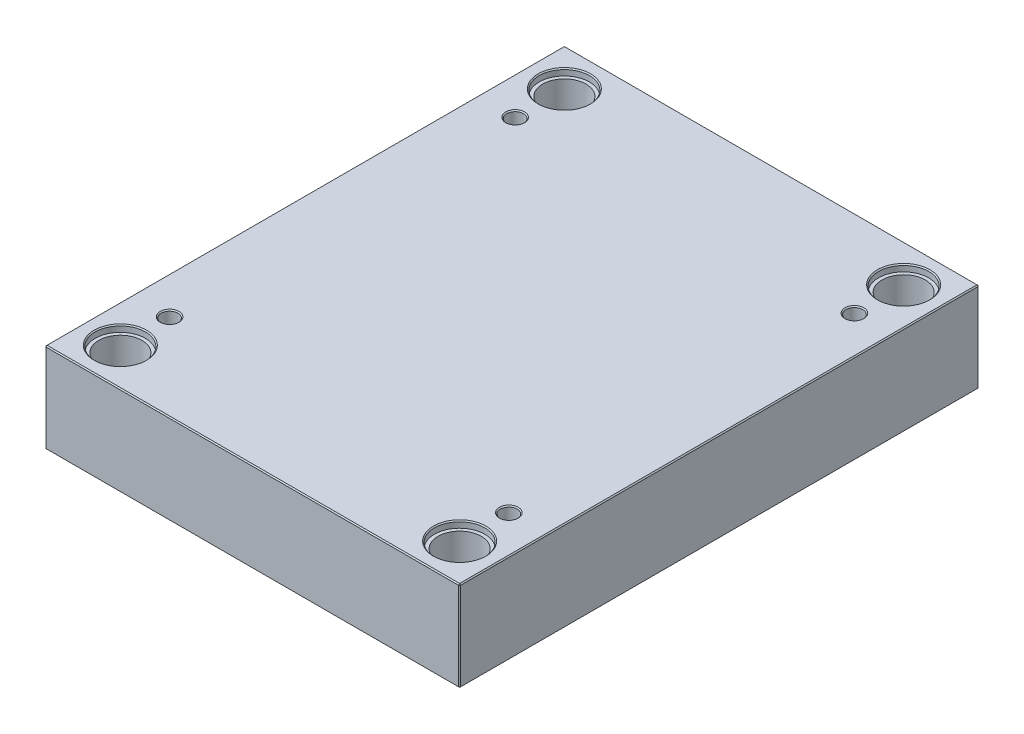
ISO-10303-21;
HEADER;
FILE_DESCRIPTION(('STEP AP214'),'2;1');
FILE_NAME('part.step','',(''),(''),'','','');
FILE_SCHEMA(('AUTOMOTIVE_DESIGN { 1 0 10303 214 1 1 1 1 }'));
ENDSEC;
DATA;
#1=APPLICATION_CONTEXT('core data for automotive mechanical design processes');
#2=APPLICATION_PROTOCOL_DEFINITION('international standard','automotive_design',2000,#1);
#3=PRODUCT_CONTEXT('',#1,'mechanical');
#4=PRODUCT('Part','Part','',(#3));
#5=PRODUCT_RELATED_PRODUCT_CATEGORY('part','',(#4));
#6=PRODUCT_DEFINITION_FORMATION('','',#4);
#7=PRODUCT_DEFINITION_CONTEXT('part definition',#1,'design');
#8=PRODUCT_DEFINITION('design','',#6,#7);
#9=PRODUCT_DEFINITION_SHAPE('','',#8);
#10=(LENGTH_UNIT() NAMED_UNIT(*) SI_UNIT(.MILLI.,.METRE.));
#11=(NAMED_UNIT(*) PLANE_ANGLE_UNIT() SI_UNIT($,.RADIAN.));
#12=(NAMED_UNIT(*) SI_UNIT($,.STERADIAN.) SOLID_ANGLE_UNIT());
#13=UNCERTAINTY_MEASURE_WITH_UNIT(LENGTH_MEASURE(1.E-05),#10,'distance_accuracy_value','');
#14=(GEOMETRIC_REPRESENTATION_CONTEXT(3) GLOBAL_UNCERTAINTY_ASSIGNED_CONTEXT((#13)) GLOBAL_UNIT_ASSIGNED_CONTEXT((#10,
#11,#12)) REPRESENTATION_CONTEXT('',''));
#15=CARTESIAN_POINT('',(0.,0.,0.));
#16=DIRECTION('',(0.,0.,1.));
#17=DIRECTION('',(1.,0.,0.));
#18=AXIS2_PLACEMENT_3D('',#15,#16,#17);
#19=CARTESIAN_POINT('',(-162.,0.,-212.));
#20=DIRECTION('',(0.,1.,0.));
#21=DIRECTION('',(0.,0.,1.));
#22=AXIS2_PLACEMENT_3D('',#19,#20,#21);
#23=CYLINDRICAL_SURFACE('',#22,20.65);
#24=CARTESIAN_POINT('',(-162.,0.999999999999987,-212.));
#25=DIRECTION('',(0.,1.,0.));
#26=DIRECTION('',(0.,0.,1.));
#27=AXIS2_PLACEMENT_3D('',#24,#25,#26);
#28=CIRCLE('',#27,20.65);
#29=CARTESIAN_POINT('',(-162.,0.999999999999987,-191.35));
#30=VERTEX_POINT('',#29);
#31=EDGE_CURVE('E471',#30,#30,#28,.F.);
#32=ORIENTED_EDGE('',*,*,#31,.T.);
#33=EDGE_LOOP('',(#32));
#34=FACE_BOUND('',#33,.T.);
#35=CARTESIAN_POINT('',(-162.,79.7,-212.));
#36=DIRECTION('',(0.,1.,0.));
#37=DIRECTION('',(0.,0.,1.));
#38=AXIS2_PLACEMENT_3D('',#35,#36,#37);
#39=CIRCLE('',#38,20.65);
#40=CARTESIAN_POINT('',(-162.,79.7,-191.35));
#41=VERTEX_POINT('',#40);
#42=EDGE_CURVE('E220',#41,#41,#39,.F.);
#43=ORIENTED_EDGE('',*,*,#42,.F.);
#44=EDGE_LOOP('',(#43));
#45=FACE_BOUND('',#44,.T.);
#46=ADVANCED_FACE('F15',(#34,#45),#23,.F.);
#47=CARTESIAN_POINT('',(162.,0.,-212.));
#48=DIRECTION('',(0.,1.,0.));
#49=DIRECTION('',(0.,0.,1.));
#50=AXIS2_PLACEMENT_3D('',#47,#48,#49);
#51=CYLINDRICAL_SURFACE('',#50,20.65);
#52=CARTESIAN_POINT('',(162.,0.999999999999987,-212.));
#53=DIRECTION('',(0.,1.,0.));
#54=DIRECTION('',(0.,0.,1.));
#55=AXIS2_PLACEMENT_3D('',#52,#53,#54);
#56=CIRCLE('',#55,20.65);
#57=CARTESIAN_POINT('',(162.,0.999999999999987,-191.35));
#58=VERTEX_POINT('',#57);
#59=EDGE_CURVE('E473',#58,#58,#56,.F.);
#60=ORIENTED_EDGE('',*,*,#59,.T.);
#61=EDGE_LOOP('',(#60));
#62=FACE_BOUND('',#61,.T.);
#63=CARTESIAN_POINT('',(162.,79.7,-212.));
#64=DIRECTION('',(0.,1.,0.));
#65=DIRECTION('',(0.,0.,1.));
#66=AXIS2_PLACEMENT_3D('',#63,#64,#65);
#67=CIRCLE('',#66,20.65);
#68=CARTESIAN_POINT('',(162.,79.7,-191.35));
#69=VERTEX_POINT('',#68);
#70=EDGE_CURVE('E217',#69,#69,#67,.F.);
#71=ORIENTED_EDGE('',*,*,#70,.F.);
#72=EDGE_LOOP('',(#71));
#73=FACE_BOUND('',#72,.T.);
#74=ADVANCED_FACE('F262',(#62,#73),#51,.F.);
#75=CARTESIAN_POINT('',(162.,0.,212.));
#76=DIRECTION('',(0.,1.,0.));
#77=DIRECTION('',(0.,0.,1.));
#78=AXIS2_PLACEMENT_3D('',#75,#76,#77);
#79=CYLINDRICAL_SURFACE('',#78,20.65);
#80=CARTESIAN_POINT('',(162.,1.00000000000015,212.));
#81=DIRECTION('',(0.,1.,0.));
#82=DIRECTION('',(0.,0.,1.));
#83=AXIS2_PLACEMENT_3D('',#80,#81,#82);
#84=CIRCLE('',#83,20.65);
#85=CARTESIAN_POINT('',(162.,1.00000000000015,232.65));
#86=VERTEX_POINT('',#85);
#87=EDGE_CURVE('E476',#86,#86,#84,.F.);
#88=ORIENTED_EDGE('',*,*,#87,.T.);
#89=EDGE_LOOP('',(#88));
#90=FACE_BOUND('',#89,.T.);
#91=CARTESIAN_POINT('',(162.,79.7,212.));
#92=DIRECTION('',(0.,1.,0.));
#93=DIRECTION('',(0.,0.,1.));
#94=AXIS2_PLACEMENT_3D('',#91,#92,#93);
#95=CIRCLE('',#94,20.65);
#96=CARTESIAN_POINT('',(162.,79.7,232.65));
#97=VERTEX_POINT('',#96);
#98=EDGE_CURVE('E213',#97,#97,#95,.F.);
#99=ORIENTED_EDGE('',*,*,#98,.F.);
#100=EDGE_LOOP('',(#99));
#101=FACE_BOUND('',#100,.T.);
#102=ADVANCED_FACE('F269',(#90,#101),#79,.F.);
#103=CARTESIAN_POINT('',(-162.,0.,212.));
#104=DIRECTION('',(0.,1.,0.));
#105=DIRECTION('',(0.,0.,1.));
#106=AXIS2_PLACEMENT_3D('',#103,#104,#105);
#107=CYLINDRICAL_SURFACE('',#106,20.65);
#108=CARTESIAN_POINT('',(-162.,0.999999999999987,212.));
#109=DIRECTION('',(0.,1.,0.));
#110=DIRECTION('',(0.,0.,1.));
#111=AXIS2_PLACEMENT_3D('',#108,#109,#110);
#112=CIRCLE('',#111,20.65);
#113=CARTESIAN_POINT('',(-162.,0.999999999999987,232.65));
#114=VERTEX_POINT('',#113);
#115=EDGE_CURVE('E479',#114,#114,#112,.F.);
#116=ORIENTED_EDGE('',*,*,#115,.T.);
#117=EDGE_LOOP('',(#116));
#118=FACE_BOUND('',#117,.T.);
#119=CARTESIAN_POINT('',(-162.,79.7,212.));
#120=DIRECTION('',(0.,1.,0.));
#121=DIRECTION('',(0.,0.,1.));
#122=AXIS2_PLACEMENT_3D('',#119,#120,#121);
#123=CIRCLE('',#122,20.65);
#124=CARTESIAN_POINT('',(-162.,79.7,232.65));
#125=VERTEX_POINT('',#124);
#126=EDGE_CURVE('E210',#125,#125,#123,.F.);
#127=ORIENTED_EDGE('',*,*,#126,.F.);
#128=EDGE_LOOP('',(#127));
#129=FACE_BOUND('',#128,.T.);
#130=ADVANCED_FACE('F276',(#118,#129),#107,.F.);
#131=CARTESIAN_POINT('',(-198.,86.,248.));
#132=DIRECTION('',(1.,0.,0.));
#133=DIRECTION('',(0.,0.,-1.));
#134=AXIS2_PLACEMENT_3D('',#131,#132,#133);
#135=PLANE('',#134);
#136=DIRECTION('',(0.,-1.,0.));
#137=VECTOR('',#136,1.);
#138=CARTESIAN_POINT('',(-198.,86.,-247.));
#139=LINE('',#138,#137);
#140=CARTESIAN_POINT('',(-198.,85.,-247.));
#141=VERTEX_POINT('',#140);
#142=CARTESIAN_POINT('',(-198.,1.00000000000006,-247.));
#143=VERTEX_POINT('',#142);
#144=EDGE_CURVE('E486',#141,#143,#139,.T.);
#145=ORIENTED_EDGE('',*,*,#144,.T.);
#146=DIRECTION('',(0.,0.,1.));
#147=VECTOR('',#146,1.);
#148=CARTESIAN_POINT('',(-198.,1.00000000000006,248.));
#149=LINE('',#148,#147);
#150=CARTESIAN_POINT('',(-198.,1.00000000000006,247.));
#151=VERTEX_POINT('',#150);
#152=EDGE_CURVE('E489',#143,#151,#149,.T.);
#153=ORIENTED_EDGE('',*,*,#152,.T.);
#154=DIRECTION('',(0.,1.,0.));
#155=VECTOR('',#154,1.);
#156=CARTESIAN_POINT('',(-198.,86.,247.));
#157=LINE('',#156,#155);
#158=CARTESIAN_POINT('',(-198.,85.,247.));
#159=VERTEX_POINT('',#158);
#160=EDGE_CURVE('E484',#151,#159,#157,.T.);
#161=ORIENTED_EDGE('',*,*,#160,.T.);
#162=DIRECTION('',(0.,0.,-1.));
#163=VECTOR('',#162,1.);
#164=CARTESIAN_POINT('',(-198.,85.,-248.));
#165=LINE('',#164,#163);
#166=EDGE_CURVE('E482',#159,#141,#165,.T.);
#167=ORIENTED_EDGE('',*,*,#166,.T.);
#168=EDGE_LOOP('',(#145,#153,#161,#167));
#169=FACE_BOUND('',#168,.T.);
#170=ADVANCED_FACE('F297',(#169),#135,.F.);
#171=CARTESIAN_POINT('',(198.,86.,248.));
#172=DIRECTION('',(0.,0.,-1.));
#173=DIRECTION('',(-1.,0.,0.));
#174=AXIS2_PLACEMENT_3D('',#171,#172,#173);
#175=PLANE('',#174);
#176=DIRECTION('',(-1.,0.,0.));
#177=VECTOR('',#176,1.);
#178=CARTESIAN_POINT('',(-198.,85.,248.));
#179=LINE('',#178,#177);
#180=CARTESIAN_POINT('',(197.,85.,248.));
#181=VERTEX_POINT('',#180);
#182=CARTESIAN_POINT('',(-197.,85.,248.));
#183=VERTEX_POINT('',#182);
#184=EDGE_CURVE('E508',#181,#183,#179,.T.);
#185=ORIENTED_EDGE('',*,*,#184,.T.);
#186=DIRECTION('',(0.,-1.,0.));
#187=VECTOR('',#186,1.);
#188=CARTESIAN_POINT('',(-197.,86.,248.));
#189=LINE('',#188,#187);
#190=CARTESIAN_POINT('',(-197.,1.,248.));
#191=VERTEX_POINT('',#190);
#192=EDGE_CURVE('E514',#183,#191,#189,.T.);
#193=ORIENTED_EDGE('',*,*,#192,.T.);
#194=DIRECTION('',(1.,0.,0.));
#195=VECTOR('',#194,1.);
#196=CARTESIAN_POINT('',(198.,1.,248.));
#197=LINE('',#196,#195);
#198=CARTESIAN_POINT('',(197.,1.,248.));
#199=VERTEX_POINT('',#198);
#200=EDGE_CURVE('E512',#191,#199,#197,.T.);
#201=ORIENTED_EDGE('',*,*,#200,.T.);
#202=DIRECTION('',(0.,1.,0.));
#203=VECTOR('',#202,1.);
#204=CARTESIAN_POINT('',(197.,86.,248.));
#205=LINE('',#204,#203);
#206=EDGE_CURVE('E510',#199,#181,#205,.T.);
#207=ORIENTED_EDGE('',*,*,#206,.T.);
#208=EDGE_LOOP('',(#185,#193,#201,#207));
#209=FACE_BOUND('',#208,.T.);
#210=ADVANCED_FACE('F293',(#209),#175,.F.);
#211=CARTESIAN_POINT('',(198.,86.,248.));
#212=DIRECTION('',(-1.,0.,0.));
#213=DIRECTION('',(0.,0.,1.));
#214=AXIS2_PLACEMENT_3D('',#211,#212,#213);
#215=PLANE('',#214);
#216=DIRECTION('',(0.,0.,-1.));
#217=VECTOR('',#216,1.);
#218=CARTESIAN_POINT('',(198.,1.,248.));
#219=LINE('',#218,#217);
#220=CARTESIAN_POINT('',(198.,1.,247.));
#221=VERTEX_POINT('',#220);
#222=CARTESIAN_POINT('',(198.,1.,-247.));
#223=VERTEX_POINT('',#222);
#224=EDGE_CURVE('E503',#221,#223,#219,.T.);
#225=ORIENTED_EDGE('',*,*,#224,.T.);
#226=DIRECTION('',(0.,1.,0.));
#227=VECTOR('',#226,1.);
#228=CARTESIAN_POINT('',(198.,86.,-247.));
#229=LINE('',#228,#227);
#230=CARTESIAN_POINT('',(198.,85.,-247.));
#231=VERTEX_POINT('',#230);
#232=EDGE_CURVE('E505',#223,#231,#229,.T.);
#233=ORIENTED_EDGE('',*,*,#232,.T.);
#234=DIRECTION('',(0.,0.,1.));
#235=VECTOR('',#234,1.);
#236=CARTESIAN_POINT('',(198.,85.,248.));
#237=LINE('',#236,#235);
#238=CARTESIAN_POINT('',(198.,85.,247.));
#239=VERTEX_POINT('',#238);
#240=EDGE_CURVE('E499',#231,#239,#237,.T.);
#241=ORIENTED_EDGE('',*,*,#240,.T.);
#242=DIRECTION('',(0.,-1.,0.));
#243=VECTOR('',#242,1.);
#244=CARTESIAN_POINT('',(198.,86.,247.));
#245=LINE('',#244,#243);
#246=EDGE_CURVE('E501',#239,#221,#245,.T.);
#247=ORIENTED_EDGE('',*,*,#246,.T.);
#248=EDGE_LOOP('',(#225,#233,#241,#247));
#249=FACE_BOUND('',#248,.T.);
#250=ADVANCED_FACE('F289',(#249),#215,.F.);
#251=CARTESIAN_POINT('',(198.,86.,-248.));
#252=DIRECTION('',(0.,0.,1.));
#253=DIRECTION('',(1.,0.,0.));
#254=AXIS2_PLACEMENT_3D('',#251,#252,#253);
#255=PLANE('',#254);
#256=DIRECTION('',(0.,-1.,0.));
#257=VECTOR('',#256,1.);
#258=CARTESIAN_POINT('',(197.,86.,-248.));
#259=LINE('',#258,#257);
#260=CARTESIAN_POINT('',(197.,85.,-248.));
#261=VERTEX_POINT('',#260);
#262=CARTESIAN_POINT('',(197.,1.,-248.));
#263=VERTEX_POINT('',#262);
#264=EDGE_CURVE('E493',#261,#263,#259,.T.);
#265=ORIENTED_EDGE('',*,*,#264,.T.);
#266=DIRECTION('',(-1.,0.,0.));
#267=VECTOR('',#266,1.);
#268=CARTESIAN_POINT('',(198.,1.,-248.));
#269=LINE('',#268,#267);
#270=CARTESIAN_POINT('',(-197.,1.,-248.));
#271=VERTEX_POINT('',#270);
#272=EDGE_CURVE('E137',#263,#271,#269,.T.);
#273=ORIENTED_EDGE('',*,*,#272,.T.);
#274=DIRECTION('',(0.,1.,0.));
#275=VECTOR('',#274,1.);
#276=CARTESIAN_POINT('',(-197.,86.,-248.));
#277=LINE('',#276,#275);
#278=CARTESIAN_POINT('',(-197.,85.,-248.));
#279=VERTEX_POINT('',#278);
#280=EDGE_CURVE('E495',#271,#279,#277,.T.);
#281=ORIENTED_EDGE('',*,*,#280,.T.);
#282=DIRECTION('',(1.,0.,0.));
#283=VECTOR('',#282,1.);
#284=CARTESIAN_POINT('',(198.,85.,-248.));
#285=LINE('',#284,#283);
#286=EDGE_CURVE('E491',#279,#261,#285,.T.);
#287=ORIENTED_EDGE('',*,*,#286,.T.);
#288=EDGE_LOOP('',(#265,#273,#281,#287));
#289=FACE_BOUND('',#288,.T.);
#290=ADVANCED_FACE('F281',(#289),#255,.F.);
#291=CARTESIAN_POINT('',(0.,86.,0.));
#292=DIRECTION('',(0.,1.,0.));
#293=DIRECTION('',(0.,0.,1.));
#294=AXIS2_PLACEMENT_3D('',#291,#292,#293);
#295=PLANE('',#294);
#296=CARTESIAN_POINT('',(162.,86.,212.));
#297=DIRECTION('',(0.,1.,0.));
#298=DIRECTION('',(0.,0.,1.));
#299=AXIS2_PLACEMENT_3D('',#296,#297,#298);
#300=CIRCLE('',#299,25.);
#301=CARTESIAN_POINT('',(162.,86.,237.));
#302=VERTEX_POINT('',#301);
#303=EDGE_CURVE('E235',#302,#302,#300,.F.);
#304=ORIENTED_EDGE('',*,*,#303,.T.);
#305=EDGE_LOOP('',(#304));
#306=FACE_BOUND('',#305,.T.);
#307=CARTESIAN_POINT('',(-162.,86.,212.));
#308=DIRECTION('',(0.,1.,0.));
#309=DIRECTION('',(0.,0.,1.));
#310=AXIS2_PLACEMENT_3D('',#307,#308,#309);
#311=CIRCLE('',#310,25.);
#312=CARTESIAN_POINT('',(-162.,86.,237.));
#313=VERTEX_POINT('',#312);
#314=EDGE_CURVE('E232',#313,#313,#311,.F.);
#315=ORIENTED_EDGE('',*,*,#314,.T.);
#316=EDGE_LOOP('',(#315));
#317=FACE_BOUND('',#316,.T.);
#318=CARTESIAN_POINT('',(162.,86.,-212.));
#319=DIRECTION('',(0.,1.,0.));
#320=DIRECTION('',(0.,0.,1.));
#321=AXIS2_PLACEMENT_3D('',#318,#319,#320);
#322=CIRCLE('',#321,25.);
#323=CARTESIAN_POINT('',(162.,86.,-187.));
#324=VERTEX_POINT('',#323);
#325=EDGE_CURVE('E229',#324,#324,#322,.F.);
#326=ORIENTED_EDGE('',*,*,#325,.T.);
#327=EDGE_LOOP('',(#326));
#328=FACE_BOUND('',#327,.T.);
#329=CARTESIAN_POINT('',(-162.,86.,-212.));
#330=DIRECTION('',(0.,1.,0.));
#331=DIRECTION('',(0.,0.,1.));
#332=AXIS2_PLACEMENT_3D('',#329,#330,#331);
#333=CIRCLE('',#332,25.);
#334=CARTESIAN_POINT('',(-162.,86.,-187.));
#335=VERTEX_POINT('',#334);
#336=EDGE_CURVE('E226',#335,#335,#333,.F.);
#337=ORIENTED_EDGE('',*,*,#336,.T.);
#338=EDGE_LOOP('',(#337));
#339=FACE_BOUND('',#338,.T.);
#340=CARTESIAN_POINT('',(-162.,86.,165.));
#341=DIRECTION('',(0.,1.,0.));
#342=DIRECTION('',(0.,0.,1.));
#343=AXIS2_PLACEMENT_3D('',#340,#341,#342);
#344=CIRCLE('',#343,9.);
#345=CARTESIAN_POINT('',(-162.,86.,174.));
#346=VERTEX_POINT('',#345);
#347=EDGE_CURVE('E197',#346,#346,#344,.F.);
#348=ORIENTED_EDGE('',*,*,#347,.T.);
#349=EDGE_LOOP('',(#348));
#350=FACE_BOUND('',#349,.T.);
#351=CARTESIAN_POINT('',(162.,86.,165.));
#352=DIRECTION('',(0.,1.,0.));
#353=DIRECTION('',(0.,0.,1.));
#354=AXIS2_PLACEMENT_3D('',#351,#352,#353);
#355=CIRCLE('',#354,9.);
#356=CARTESIAN_POINT('',(162.,86.,174.));
#357=VERTEX_POINT('',#356);
#358=EDGE_CURVE('E194',#357,#357,#355,.F.);
#359=ORIENTED_EDGE('',*,*,#358,.T.);
#360=EDGE_LOOP('',(#359));
#361=FACE_BOUND('',#360,.T.);
#362=CARTESIAN_POINT('',(162.,86.,-165.));
#363=DIRECTION('',(0.,1.,0.));
#364=DIRECTION('',(0.,0.,1.));
#365=AXIS2_PLACEMENT_3D('',#362,#363,#364);
#366=CIRCLE('',#365,9.);
#367=CARTESIAN_POINT('',(162.,86.,-156.));
#368=VERTEX_POINT('',#367);
#369=EDGE_CURVE('E191',#368,#368,#366,.F.);
#370=ORIENTED_EDGE('',*,*,#369,.T.);
#371=EDGE_LOOP('',(#370));
#372=FACE_BOUND('',#371,.T.);
#373=CARTESIAN_POINT('',(-162.,86.,-165.));
#374=DIRECTION('',(0.,1.,0.));
#375=DIRECTION('',(0.,0.,1.));
#376=AXIS2_PLACEMENT_3D('',#373,#374,#375);
#377=CIRCLE('',#376,9.);
#378=CARTESIAN_POINT('',(-162.,86.,-156.));
#379=VERTEX_POINT('',#378);
#380=EDGE_CURVE('E187',#379,#379,#377,.F.);
#381=ORIENTED_EDGE('',*,*,#380,.T.);
#382=EDGE_LOOP('',(#381));
#383=FACE_BOUND('',#382,.T.);
#384=DIRECTION('',(0.,0.,-1.));
#385=VECTOR('',#384,1.);
#386=CARTESIAN_POINT('',(197.,86.,-248.));
#387=LINE('',#386,#385);
#388=CARTESIAN_POINT('',(197.,86.,247.));
#389=VERTEX_POINT('',#388);
#390=CARTESIAN_POINT('',(197.,86.,-247.));
#391=VERTEX_POINT('',#390);
#392=EDGE_CURVE('E30',#389,#391,#387,.T.);
#393=ORIENTED_EDGE('',*,*,#392,.T.);
#394=DIRECTION('',(-1.,0.,0.));
#395=VECTOR('',#394,1.);
#396=CARTESIAN_POINT('',(-198.,86.,-247.));
#397=LINE('',#396,#395);
#398=CARTESIAN_POINT('',(-197.,86.,-247.));
#399=VERTEX_POINT('',#398);
#400=EDGE_CURVE('E188',#391,#399,#397,.T.);
#401=ORIENTED_EDGE('',*,*,#400,.T.);
#402=DIRECTION('',(0.,0.,1.));
#403=VECTOR('',#402,1.);
#404=CARTESIAN_POINT('',(-197.,86.,248.));
#405=LINE('',#404,#403);
#406=CARTESIAN_POINT('',(-197.,86.,247.));
#407=VERTEX_POINT('',#406);
#408=EDGE_CURVE('E517',#399,#407,#405,.T.);
#409=ORIENTED_EDGE('',*,*,#408,.T.);
#410=DIRECTION('',(1.,0.,0.));
#411=VECTOR('',#410,1.);
#412=CARTESIAN_POINT('',(198.,86.,247.));
#413=LINE('',#412,#411);
#414=EDGE_CURVE('E35',#407,#389,#413,.T.);
#415=ORIENTED_EDGE('',*,*,#414,.T.);
#416=EDGE_LOOP('',(#393,#401,#409,#415));
#417=FACE_BOUND('',#416,.T.);
#418=ADVANCED_FACE('F278',(#306,#317,#328,#339,#350,#361,#372,#383,#417),#295,.T.);
#419=CARTESIAN_POINT('',(0.,0.,0.));
#420=DIRECTION('',(0.,1.,0.));
#421=DIRECTION('',(0.,0.,1.));
#422=AXIS2_PLACEMENT_3D('',#419,#420,#421);
#423=PLANE('',#422);
#424=CARTESIAN_POINT('',(-162.,0.,-212.));
#425=DIRECTION('',(0.,1.,0.));
#426=DIRECTION('',(0.,0.,1.));
#427=AXIS2_PLACEMENT_3D('',#424,#425,#426);
#428=CIRCLE('',#427,21.65);
#429=CARTESIAN_POINT('',(-162.,0.,-190.35));
#430=VERTEX_POINT('',#429);
#431=EDGE_CURVE('E468',#430,#430,#428,.T.);
#432=ORIENTED_EDGE('',*,*,#431,.T.);
#433=EDGE_LOOP('',(#432));
#434=FACE_BOUND('',#433,.T.);
#435=CARTESIAN_POINT('',(162.,0.,-212.));
#436=DIRECTION('',(0.,1.,0.));
#437=DIRECTION('',(0.,0.,1.));
#438=AXIS2_PLACEMENT_3D('',#435,#436,#437);
#439=CIRCLE('',#438,21.65);
#440=CARTESIAN_POINT('',(162.,0.,-190.35));
#441=VERTEX_POINT('',#440);
#442=EDGE_CURVE('E465',#441,#441,#439,.T.);
#443=ORIENTED_EDGE('',*,*,#442,.T.);
#444=EDGE_LOOP('',(#443));
#445=FACE_BOUND('',#444,.T.);
#446=CARTESIAN_POINT('',(162.,0.,212.));
#447=DIRECTION('',(0.,1.,0.));
#448=DIRECTION('',(0.,0.,1.));
#449=AXIS2_PLACEMENT_3D('',#446,#447,#448);
#450=CIRCLE('',#449,21.6500000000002);
#451=CARTESIAN_POINT('',(162.,0.,233.65));
#452=VERTEX_POINT('',#451);
#453=EDGE_CURVE('E462',#452,#452,#450,.T.);
#454=ORIENTED_EDGE('',*,*,#453,.T.);
#455=EDGE_LOOP('',(#454));
#456=FACE_BOUND('',#455,.T.);
#457=CARTESIAN_POINT('',(-162.,0.,212.));
#458=DIRECTION('',(0.,1.,0.));
#459=DIRECTION('',(0.,0.,1.));
#460=AXIS2_PLACEMENT_3D('',#457,#458,#459);
#461=CIRCLE('',#460,21.65);
#462=CARTESIAN_POINT('',(-162.,0.,233.65));
#463=VERTEX_POINT('',#462);
#464=EDGE_CURVE('E459',#463,#463,#461,.T.);
#465=ORIENTED_EDGE('',*,*,#464,.T.);
#466=EDGE_LOOP('',(#465));
#467=FACE_BOUND('',#466,.T.);
#468=DIRECTION('',(0.,0.,1.));
#469=VECTOR('',#468,1.);
#470=CARTESIAN_POINT('',(197.,0.,0.));
#471=LINE('',#470,#469);
#472=CARTESIAN_POINT('',(197.,0.,-247.));
#473=VERTEX_POINT('',#472);
#474=CARTESIAN_POINT('',(197.,0.,247.));
#475=VERTEX_POINT('',#474);
#476=EDGE_CURVE('E107',#473,#475,#471,.T.);
#477=ORIENTED_EDGE('',*,*,#476,.T.);
#478=DIRECTION('',(-1.,0.,0.));
#479=VECTOR('',#478,1.);
#480=CARTESIAN_POINT('',(0.,0.,247.));
#481=LINE('',#480,#479);
#482=CARTESIAN_POINT('',(-197.,0.,247.));
#483=VERTEX_POINT('',#482);
#484=EDGE_CURVE('E457',#475,#483,#481,.T.);
#485=ORIENTED_EDGE('',*,*,#484,.T.);
#486=DIRECTION('',(0.,0.,-1.));
#487=VECTOR('',#486,1.);
#488=CARTESIAN_POINT('',(-197.,0.,0.));
#489=LINE('',#488,#487);
#490=CARTESIAN_POINT('',(-197.,0.,-247.));
#491=VERTEX_POINT('',#490);
#492=EDGE_CURVE('E109',#483,#491,#489,.T.);
#493=ORIENTED_EDGE('',*,*,#492,.T.);
#494=DIRECTION('',(1.,0.,0.));
#495=VECTOR('',#494,1.);
#496=CARTESIAN_POINT('',(0.,0.,-247.));
#497=LINE('',#496,#495);
#498=EDGE_CURVE('E103',#491,#473,#497,.T.);
#499=ORIENTED_EDGE('',*,*,#498,.T.);
#500=EDGE_LOOP('',(#477,#485,#493,#499));
#501=FACE_BOUND('',#500,.T.);
#502=ADVANCED_FACE('F105',(#434,#445,#456,#467,#501),#423,.F.);
#503=CARTESIAN_POINT('',(-162.,0.,-212.));
#504=DIRECTION('',(0.,-1.,0.));
#505=DIRECTION('',(0.,0.,-1.));
#506=AXIS2_PLACEMENT_3D('',#503,#504,#505);
#507=CONICAL_SURFACE('',#506,21.65,0.785398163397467);
#508=ORIENTED_EDGE('',*,*,#31,.F.);
#509=EDGE_LOOP('',(#508));
#510=FACE_BOUND('',#509,.T.);
#511=ORIENTED_EDGE('',*,*,#431,.F.);
#512=EDGE_LOOP('',(#511));
#513=FACE_BOUND('',#512,.T.);
#514=ADVANCED_FACE('F285',(#510,#513),#507,.F.);
#515=CARTESIAN_POINT('',(162.,0.,-212.));
#516=DIRECTION('',(0.,-1.,0.));
#517=DIRECTION('',(0.,0.,-1.));
#518=AXIS2_PLACEMENT_3D('',#515,#516,#517);
#519=CONICAL_SURFACE('',#518,21.65,0.785398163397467);
#520=ORIENTED_EDGE('',*,*,#59,.F.);
#521=EDGE_LOOP('',(#520));
#522=FACE_BOUND('',#521,.T.);
#523=ORIENTED_EDGE('',*,*,#442,.F.);
#524=EDGE_LOOP('',(#523));
#525=FACE_BOUND('',#524,.T.);
#526=ADVANCED_FACE('F304',(#522,#525),#519,.F.);
#527=CARTESIAN_POINT('',(162.,0.,212.));
#528=DIRECTION('',(0.,-1.,0.));
#529=DIRECTION('',(0.,0.,-1.));
#530=AXIS2_PLACEMENT_3D('',#527,#528,#529);
#531=CONICAL_SURFACE('',#530,21.6500000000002,0.785398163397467);
#532=ORIENTED_EDGE('',*,*,#87,.F.);
#533=EDGE_LOOP('',(#532));
#534=FACE_BOUND('',#533,.T.);
#535=ORIENTED_EDGE('',*,*,#453,.F.);
#536=EDGE_LOOP('',(#535));
#537=FACE_BOUND('',#536,.T.);
#538=ADVANCED_FACE('F308',(#534,#537),#531,.F.);
#539=CARTESIAN_POINT('',(-162.,0.,212.));
#540=DIRECTION('',(0.,-1.,0.));
#541=DIRECTION('',(0.,0.,-1.));
#542=AXIS2_PLACEMENT_3D('',#539,#540,#541);
#543=CONICAL_SURFACE('',#542,21.65,0.785398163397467);
#544=ORIENTED_EDGE('',*,*,#115,.F.);
#545=EDGE_LOOP('',(#544));
#546=FACE_BOUND('',#545,.T.);
#547=ORIENTED_EDGE('',*,*,#464,.F.);
#548=EDGE_LOOP('',(#547));
#549=FACE_BOUND('',#548,.T.);
#550=ADVANCED_FACE('F312',(#546,#549),#543,.F.);
#551=CARTESIAN_POINT('',(198.,86.,247.));
#552=DIRECTION('',(-0.707106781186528,0.,-0.707106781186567));
#553=DIRECTION('',(0.,-1.,0.));
#554=AXIS2_PLACEMENT_3D('',#551,#552,#553);
#555=PLANE('',#554);
#556=DIRECTION('',(-0.707106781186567,0.,0.707106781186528));
#557=VECTOR('',#556,1.);
#558=CARTESIAN_POINT('',(197.,85.,248.));
#559=LINE('',#558,#557);
#560=EDGE_CURVE('E125',#181,#239,#559,.F.);
#561=ORIENTED_EDGE('',*,*,#560,.F.);
#562=ORIENTED_EDGE('',*,*,#206,.F.);
#563=DIRECTION('',(0.707106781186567,0.,-0.707106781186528));
#564=VECTOR('',#563,1.);
#565=CARTESIAN_POINT('',(197.,1.,248.));
#566=LINE('',#565,#564);
#567=EDGE_CURVE('E179',#221,#199,#566,.F.);
#568=ORIENTED_EDGE('',*,*,#567,.F.);
#569=ORIENTED_EDGE('',*,*,#246,.F.);
#570=EDGE_LOOP('',(#561,#562,#568,#569));
#571=FACE_BOUND('',#570,.T.);
#572=ADVANCED_FACE('F316',(#571),#555,.F.);
#573=CARTESIAN_POINT('',(197.,85.,248.));
#574=DIRECTION('',(0.577350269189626,0.577350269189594,0.577350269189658));
#575=DIRECTION('',(0.707106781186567,0.,-0.707106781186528));
#576=AXIS2_PLACEMENT_3D('',#573,#574,#575);
#577=PLANE('',#576);
#578=DIRECTION('',(0.,-0.707106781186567,0.707106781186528));
#579=VECTOR('',#578,1.);
#580=CARTESIAN_POINT('',(197.,85.,248.));
#581=LINE('',#580,#579);
#582=EDGE_CURVE('E174',#181,#389,#581,.F.);
#583=ORIENTED_EDGE('',*,*,#582,.F.);
#584=ORIENTED_EDGE('',*,*,#560,.T.);
#585=DIRECTION('',(-0.707106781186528,0.707106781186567,0.));
#586=VECTOR('',#585,1.);
#587=CARTESIAN_POINT('',(197.5,85.5,247.));
#588=LINE('',#587,#586);
#589=EDGE_CURVE('E176',#389,#239,#588,.F.);
#590=ORIENTED_EDGE('',*,*,#589,.F.);
#591=EDGE_LOOP('',(#583,#584,#590));
#592=FACE_BOUND('',#591,.T.);
#593=ADVANCED_FACE('F384',(#592),#577,.T.);
#594=CARTESIAN_POINT('',(197.,1.,248.));
#595=DIRECTION('',(0.577350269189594,-0.577350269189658,0.577350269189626));
#596=DIRECTION('',(0.,-0.707106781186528,-0.707106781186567));
#597=AXIS2_PLACEMENT_3D('',#594,#595,#596);
#598=PLANE('',#597);
#599=DIRECTION('',(-0.707106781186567,-0.707106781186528,0.));
#600=VECTOR('',#599,1.);
#601=CARTESIAN_POINT('',(197.5,0.5,247.));
#602=LINE('',#601,#600);
#603=EDGE_CURVE('E123',#221,#475,#602,.T.);
#604=ORIENTED_EDGE('',*,*,#603,.F.);
#605=ORIENTED_EDGE('',*,*,#567,.T.);
#606=DIRECTION('',(0.,0.707106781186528,0.707106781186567));
#607=VECTOR('',#606,1.);
#608=CARTESIAN_POINT('',(197.,1.,248.));
#609=LINE('',#608,#607);
#610=EDGE_CURVE('E171',#475,#199,#609,.T.);
#611=ORIENTED_EDGE('',*,*,#610,.F.);
#612=EDGE_LOOP('',(#604,#605,#611));
#613=FACE_BOUND('',#612,.T.);
#614=ADVANCED_FACE('F380',(#613),#598,.T.);
#615=CARTESIAN_POINT('',(197.,86.,0.));
#616=DIRECTION('',(0.707106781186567,0.707106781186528,0.));
#617=DIRECTION('',(0.,0.,1.));
#618=AXIS2_PLACEMENT_3D('',#615,#616,#617);
#619=PLANE('',#618);
#620=ORIENTED_EDGE('',*,*,#589,.T.);
#621=ORIENTED_EDGE('',*,*,#240,.F.);
#622=DIRECTION('',(0.707106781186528,-0.707106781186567,0.));
#623=VECTOR('',#622,1.);
#624=CARTESIAN_POINT('',(198.,85.,-247.));
#625=LINE('',#624,#623);
#626=EDGE_CURVE('E165',#391,#231,#625,.T.);
#627=ORIENTED_EDGE('',*,*,#626,.F.);
#628=ORIENTED_EDGE('',*,*,#392,.F.);
#629=EDGE_LOOP('',(#620,#621,#627,#628));
#630=FACE_BOUND('',#629,.T.);
#631=ADVANCED_FACE('F376',(#630),#619,.T.);
#632=CARTESIAN_POINT('',(0.,86.,247.));
#633=DIRECTION('',(0.,0.707106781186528,0.707106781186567));
#634=DIRECTION('',(-1.,0.,0.));
#635=AXIS2_PLACEMENT_3D('',#632,#633,#634);
#636=PLANE('',#635);
#637=ORIENTED_EDGE('',*,*,#582,.T.);
#638=ORIENTED_EDGE('',*,*,#414,.F.);
#639=DIRECTION('',(0.,0.707106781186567,-0.707106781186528));
#640=VECTOR('',#639,1.);
#641=CARTESIAN_POINT('',(-197.,85.5,247.5));
#642=LINE('',#641,#640);
#643=EDGE_CURVE('E162',#183,#407,#642,.T.);
#644=ORIENTED_EDGE('',*,*,#643,.F.);
#645=ORIENTED_EDGE('',*,*,#184,.F.);
#646=EDGE_LOOP('',(#637,#638,#644,#645));
#647=FACE_BOUND('',#646,.T.);
#648=ADVANCED_FACE('F372',(#647),#636,.T.);
#649=CARTESIAN_POINT('',(-197.,86.,248.));
#650=DIRECTION('',(0.707106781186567,0.,-0.707106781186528));
#651=DIRECTION('',(0.,-1.,0.));
#652=AXIS2_PLACEMENT_3D('',#649,#650,#651);
#653=PLANE('',#652);
#654=DIRECTION('',(0.707106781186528,0.,0.707106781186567));
#655=VECTOR('',#654,1.);
#656=CARTESIAN_POINT('',(-197.,1.,248.));
#657=LINE('',#656,#655);
#658=EDGE_CURVE('E156',#191,#151,#657,.F.);
#659=ORIENTED_EDGE('',*,*,#658,.F.);
#660=ORIENTED_EDGE('',*,*,#192,.F.);
#661=DIRECTION('',(-0.707106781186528,0.,-0.707106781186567));
#662=VECTOR('',#661,1.);
#663=CARTESIAN_POINT('',(-198.,85.,247.));
#664=LINE('',#663,#662);
#665=EDGE_CURVE('E159',#159,#183,#664,.F.);
#666=ORIENTED_EDGE('',*,*,#665,.F.);
#667=ORIENTED_EDGE('',*,*,#160,.F.);
#668=EDGE_LOOP('',(#659,#660,#666,#667));
#669=FACE_BOUND('',#668,.T.);
#670=ADVANCED_FACE('F368',(#669),#653,.F.);
#671=CARTESIAN_POINT('',(198.,1.,248.));
#672=DIRECTION('',(0.,0.707106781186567,-0.707106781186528));
#673=DIRECTION('',(1.,0.,0.));
#674=AXIS2_PLACEMENT_3D('',#671,#672,#673);
#675=PLANE('',#674);
#676=ORIENTED_EDGE('',*,*,#610,.T.);
#677=ORIENTED_EDGE('',*,*,#200,.F.);
#678=DIRECTION('',(0.,-0.707106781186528,-0.707106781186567));
#679=VECTOR('',#678,1.);
#680=CARTESIAN_POINT('',(-197.,1.,248.));
#681=LINE('',#680,#679);
#682=EDGE_CURVE('E134',#483,#191,#681,.F.);
#683=ORIENTED_EDGE('',*,*,#682,.F.);
#684=ORIENTED_EDGE('',*,*,#484,.F.);
#685=EDGE_LOOP('',(#676,#677,#683,#684));
#686=FACE_BOUND('',#685,.T.);
#687=ADVANCED_FACE('F365',(#686),#675,.F.);
#688=CARTESIAN_POINT('',(198.,1.,248.));
#689=DIRECTION('',(-0.707106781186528,0.707106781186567,0.));
#690=DIRECTION('',(0.,0.,-1.));
#691=AXIS2_PLACEMENT_3D('',#688,#689,#690);
#692=PLANE('',#691);
#693=ORIENTED_EDGE('',*,*,#603,.T.);
#694=ORIENTED_EDGE('',*,*,#476,.F.);
#695=DIRECTION('',(0.707106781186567,0.707106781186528,0.));
#696=VECTOR('',#695,1.);
#697=CARTESIAN_POINT('',(197.5,0.499999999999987,-247.));
#698=LINE('',#697,#696);
#699=EDGE_CURVE('E120',#223,#473,#698,.F.);
#700=ORIENTED_EDGE('',*,*,#699,.F.);
#701=ORIENTED_EDGE('',*,*,#224,.F.);
#702=EDGE_LOOP('',(#693,#694,#700,#701));
#703=FACE_BOUND('',#702,.T.);
#704=ADVANCED_FACE('F118',(#703),#692,.F.);
#705=CARTESIAN_POINT('',(197.,86.,-248.));
#706=DIRECTION('',(-0.707106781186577,0.,0.707106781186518));
#707=DIRECTION('',(0.,-1.,0.));
#708=AXIS2_PLACEMENT_3D('',#705,#706,#707);
#709=PLANE('',#708);
#710=DIRECTION('',(0.707106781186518,0.,0.707106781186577));
#711=VECTOR('',#710,1.);
#712=CARTESIAN_POINT('',(198.,85.,-247.));
#713=LINE('',#712,#711);
#714=EDGE_CURVE('E167',#231,#261,#713,.F.);
#715=ORIENTED_EDGE('',*,*,#714,.F.);
#716=ORIENTED_EDGE('',*,*,#232,.F.);
#717=DIRECTION('',(-0.707106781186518,0.,-0.707106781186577));
#718=VECTOR('',#717,1.);
#719=CARTESIAN_POINT('',(197.,1.,-248.));
#720=LINE('',#719,#718);
#721=EDGE_CURVE('E133',#263,#223,#720,.F.);
#722=ORIENTED_EDGE('',*,*,#721,.F.);
#723=ORIENTED_EDGE('',*,*,#264,.F.);
#724=EDGE_LOOP('',(#715,#716,#722,#723));
#725=FACE_BOUND('',#724,.T.);
#726=ADVANCED_FACE('F358',(#725),#709,.F.);
#727=CARTESIAN_POINT('',(198.,85.,-247.));
#728=DIRECTION('',(0.577350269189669,0.577350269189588,-0.57735026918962));
#729=DIRECTION('',(-0.707106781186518,0.,-0.707106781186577));
#730=AXIS2_PLACEMENT_3D('',#727,#728,#729);
#731=PLANE('',#730);
#732=ORIENTED_EDGE('',*,*,#626,.T.);
#733=ORIENTED_EDGE('',*,*,#714,.T.);
#734=DIRECTION('',(0.,0.707106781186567,0.707106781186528));
#735=VECTOR('',#734,1.);
#736=CARTESIAN_POINT('',(197.,85.5,-247.5));
#737=LINE('',#736,#735);
#738=EDGE_CURVE('E151',#391,#261,#737,.F.);
#739=ORIENTED_EDGE('',*,*,#738,.F.);
#740=EDGE_LOOP('',(#732,#733,#739));
#741=FACE_BOUND('',#740,.T.);
#742=ADVANCED_FACE('F354',(#741),#731,.T.);
#743=CARTESIAN_POINT('',(-198.,85.,247.));
#744=DIRECTION('',(-0.577350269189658,0.577350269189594,0.577350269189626));
#745=DIRECTION('',(0.707106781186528,0.,0.707106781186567));
#746=AXIS2_PLACEMENT_3D('',#743,#744,#745);
#747=PLANE('',#746);
#748=ORIENTED_EDGE('',*,*,#665,.T.);
#749=ORIENTED_EDGE('',*,*,#643,.T.);
#750=DIRECTION('',(-0.707106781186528,-0.707106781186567,0.));
#751=VECTOR('',#750,1.);
#752=CARTESIAN_POINT('',(-198.,85.,247.));
#753=LINE('',#752,#751);
#754=EDGE_CURVE('E142',#159,#407,#753,.F.);
#755=ORIENTED_EDGE('',*,*,#754,.F.);
#756=EDGE_LOOP('',(#748,#749,#755));
#757=FACE_BOUND('',#756,.T.);
#758=ADVANCED_FACE('F350',(#757),#747,.T.);
#759=CARTESIAN_POINT('',(-197.,1.,248.));
#760=DIRECTION('',(-0.577350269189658,-0.577350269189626,0.577350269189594));
#761=DIRECTION('',(0.707106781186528,-0.707106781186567,0.));
#762=AXIS2_PLACEMENT_3D('',#759,#760,#761);
#763=PLANE('',#762);
#764=ORIENTED_EDGE('',*,*,#682,.T.);
#765=ORIENTED_EDGE('',*,*,#658,.T.);
#766=DIRECTION('',(-0.707106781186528,0.707106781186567,0.));
#767=VECTOR('',#766,1.);
#768=CARTESIAN_POINT('',(-197.5,0.500000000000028,247.));
#769=LINE('',#768,#767);
#770=EDGE_CURVE('E138',#483,#151,#769,.T.);
#771=ORIENTED_EDGE('',*,*,#770,.F.);
#772=EDGE_LOOP('',(#764,#765,#771));
#773=FACE_BOUND('',#772,.T.);
#774=ADVANCED_FACE('F347',(#773),#763,.T.);
#775=CARTESIAN_POINT('',(197.,1.,-248.));
#776=DIRECTION('',(0.577350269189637,-0.577350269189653,-0.577350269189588));
#777=DIRECTION('',(0.707106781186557,0.707106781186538,0.));
#778=AXIS2_PLACEMENT_3D('',#775,#776,#777);
#779=PLANE('',#778);
#780=ORIENTED_EDGE('',*,*,#721,.T.);
#781=ORIENTED_EDGE('',*,*,#699,.T.);
#782=DIRECTION('',(0.,-0.707106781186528,0.707106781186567));
#783=VECTOR('',#782,1.);
#784=CARTESIAN_POINT('',(197.,1.,-248.));
#785=LINE('',#784,#783);
#786=EDGE_CURVE('E130',#263,#473,#785,.T.);
#787=ORIENTED_EDGE('',*,*,#786,.F.);
#788=EDGE_LOOP('',(#780,#781,#787));
#789=FACE_BOUND('',#788,.T.);
#790=ADVANCED_FACE('F129',(#789),#779,.T.);
#791=CARTESIAN_POINT('',(0.,86.,-247.));
#792=DIRECTION('',(0.,0.707106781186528,-0.707106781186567));
#793=DIRECTION('',(1.,0.,0.));
#794=AXIS2_PLACEMENT_3D('',#791,#792,#793);
#795=PLANE('',#794);
#796=ORIENTED_EDGE('',*,*,#738,.T.);
#797=ORIENTED_EDGE('',*,*,#286,.F.);
#798=DIRECTION('',(0.,-0.707106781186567,-0.707106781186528));
#799=VECTOR('',#798,1.);
#800=CARTESIAN_POINT('',(-197.,85.,-248.));
#801=LINE('',#800,#799);
#802=EDGE_CURVE('E139',#399,#279,#801,.T.);
#803=ORIENTED_EDGE('',*,*,#802,.F.);
#804=ORIENTED_EDGE('',*,*,#400,.F.);
#805=EDGE_LOOP('',(#796,#797,#803,#804));
#806=FACE_BOUND('',#805,.T.);
#807=ADVANCED_FACE('F340',(#806),#795,.T.);
#808=CARTESIAN_POINT('',(-197.,86.,0.));
#809=DIRECTION('',(-0.707106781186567,0.707106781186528,0.));
#810=DIRECTION('',(0.,0.,-1.));
#811=AXIS2_PLACEMENT_3D('',#808,#809,#810);
#812=PLANE('',#811);
#813=ORIENTED_EDGE('',*,*,#754,.T.);
#814=ORIENTED_EDGE('',*,*,#408,.F.);
#815=DIRECTION('',(0.707106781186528,0.707106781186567,0.));
#816=VECTOR('',#815,1.);
#817=CARTESIAN_POINT('',(-197.5,85.5,-247.));
#818=LINE('',#817,#816);
#819=EDGE_CURVE('E145',#141,#399,#818,.T.);
#820=ORIENTED_EDGE('',*,*,#819,.F.);
#821=ORIENTED_EDGE('',*,*,#166,.F.);
#822=EDGE_LOOP('',(#813,#814,#820,#821));
#823=FACE_BOUND('',#822,.T.);
#824=ADVANCED_FACE('F336',(#823),#812,.T.);
#825=CARTESIAN_POINT('',(-198.,1.00000000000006,248.));
#826=DIRECTION('',(0.707106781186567,0.707106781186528,0.));
#827=DIRECTION('',(0.,0.,1.));
#828=AXIS2_PLACEMENT_3D('',#825,#826,#827);
#829=PLANE('',#828);
#830=ORIENTED_EDGE('',*,*,#770,.T.);
#831=ORIENTED_EDGE('',*,*,#152,.F.);
#832=DIRECTION('',(0.707106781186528,-0.707106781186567,0.));
#833=VECTOR('',#832,1.);
#834=CARTESIAN_POINT('',(-198.,1.00000000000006,-247.));
#835=LINE('',#834,#833);
#836=EDGE_CURVE('E528',#491,#143,#835,.F.);
#837=ORIENTED_EDGE('',*,*,#836,.F.);
#838=ORIENTED_EDGE('',*,*,#492,.F.);
#839=EDGE_LOOP('',(#830,#831,#837,#838));
#840=FACE_BOUND('',#839,.T.);
#841=ADVANCED_FACE('F333',(#840),#829,.F.);
#842=CARTESIAN_POINT('',(198.,1.,-248.));
#843=DIRECTION('',(0.,0.707106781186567,0.707106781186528));
#844=DIRECTION('',(-1.,0.,0.));
#845=AXIS2_PLACEMENT_3D('',#842,#843,#844);
#846=PLANE('',#845);
#847=ORIENTED_EDGE('',*,*,#786,.T.);
#848=ORIENTED_EDGE('',*,*,#498,.F.);
#849=DIRECTION('',(0.,0.707106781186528,-0.707106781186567));
#850=VECTOR('',#849,1.);
#851=CARTESIAN_POINT('',(-197.,0.500000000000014,-247.5));
#852=LINE('',#851,#850);
#853=EDGE_CURVE('E525',#271,#491,#852,.F.);
#854=ORIENTED_EDGE('',*,*,#853,.F.);
#855=ORIENTED_EDGE('',*,*,#272,.F.);
#856=EDGE_LOOP('',(#847,#848,#854,#855));
#857=FACE_BOUND('',#856,.T.);
#858=ADVANCED_FACE('F136',(#857),#846,.F.);
#859=CARTESIAN_POINT('',(-197.,85.,-248.));
#860=DIRECTION('',(-0.577350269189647,0.577350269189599,-0.577350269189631));
#861=DIRECTION('',(-0.707106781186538,0.,0.707106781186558));
#862=AXIS2_PLACEMENT_3D('',#859,#860,#861);
#863=PLANE('',#862);
#864=ORIENTED_EDGE('',*,*,#819,.T.);
#865=ORIENTED_EDGE('',*,*,#802,.T.);
#866=DIRECTION('',(0.707106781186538,0.,-0.707106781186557));
#867=VECTOR('',#866,1.);
#868=CARTESIAN_POINT('',(-197.,85.,-248.));
#869=LINE('',#868,#867);
#870=EDGE_CURVE('E523',#141,#279,#869,.T.);
#871=ORIENTED_EDGE('',*,*,#870,.F.);
#872=EDGE_LOOP('',(#864,#865,#871));
#873=FACE_BOUND('',#872,.T.);
#874=ADVANCED_FACE('F326',(#873),#863,.T.);
#875=CARTESIAN_POINT('',(-198.,1.00000000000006,-247.));
#876=DIRECTION('',(-0.577350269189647,-0.577350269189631,-0.577350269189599));
#877=DIRECTION('',(0.707106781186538,-0.707106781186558,0.));
#878=AXIS2_PLACEMENT_3D('',#875,#876,#877);
#879=PLANE('',#878);
#880=ORIENTED_EDGE('',*,*,#853,.T.);
#881=ORIENTED_EDGE('',*,*,#836,.T.);
#882=DIRECTION('',(-0.707106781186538,0.,0.707106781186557));
#883=VECTOR('',#882,1.);
#884=CARTESIAN_POINT('',(-198.,1.00000000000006,-247.));
#885=LINE('',#884,#883);
#886=EDGE_CURVE('E454',#271,#143,#885,.T.);
#887=ORIENTED_EDGE('',*,*,#886,.F.);
#888=EDGE_LOOP('',(#880,#881,#887));
#889=FACE_BOUND('',#888,.T.);
#890=ADVANCED_FACE('F322',(#889),#879,.T.);
#891=CARTESIAN_POINT('',(-198.,86.,-247.));
#892=DIRECTION('',(0.707106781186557,0.,0.707106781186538));
#893=DIRECTION('',(0.,-1.,0.));
#894=AXIS2_PLACEMENT_3D('',#891,#892,#893);
#895=PLANE('',#894);
#896=ORIENTED_EDGE('',*,*,#870,.T.);
#897=ORIENTED_EDGE('',*,*,#280,.F.);
#898=ORIENTED_EDGE('',*,*,#886,.T.);
#899=ORIENTED_EDGE('',*,*,#144,.F.);
#900=EDGE_LOOP('',(#896,#897,#898,#899));
#901=FACE_BOUND('',#900,.T.);
#902=ADVANCED_FACE('F318',(#901),#895,.F.);
#903=CARTESIAN_POINT('',(-162.,61.,-165.));
#904=DIRECTION('',(0.,1.,0.));
#905=DIRECTION('',(0.,0.,1.));
#906=AXIS2_PLACEMENT_3D('',#903,#904,#905);
#907=CYLINDRICAL_SURFACE('',#906,8.);
#908=CARTESIAN_POINT('',(-162.,85.,-165.));
#909=DIRECTION('',(0.,1.,0.));
#910=DIRECTION('',(0.,0.,1.));
#911=AXIS2_PLACEMENT_3D('',#908,#909,#910);
#912=CIRCLE('',#911,8.);
#913=CARTESIAN_POINT('',(-162.,85.,-157.));
#914=VERTEX_POINT('',#913);
#915=EDGE_CURVE('E206',#914,#914,#912,.T.);
#916=ORIENTED_EDGE('',*,*,#915,.T.);
#917=EDGE_LOOP('',(#916));
#918=FACE_BOUND('',#917,.T.);
#919=CARTESIAN_POINT('',(-162.,61.,-165.));
#920=DIRECTION('',(0.,1.,0.));
#921=DIRECTION('',(0.,0.,1.));
#922=AXIS2_PLACEMENT_3D('',#919,#920,#921);
#923=CIRCLE('',#922,8.);
#924=CARTESIAN_POINT('',(-162.,61.,-157.));
#925=VERTEX_POINT('',#924);
#926=EDGE_CURVE('E447',#925,#925,#923,.T.);
#927=ORIENTED_EDGE('',*,*,#926,.F.);
#928=EDGE_LOOP('',(#927));
#929=FACE_BOUND('',#928,.T.);
#930=ADVANCED_FACE('F321',(#918,#929),#907,.F.);
#931=CARTESIAN_POINT('',(-162.,61.,-165.));
#932=DIRECTION('',(0.,1.,0.));
#933=DIRECTION('',(0.,0.,1.));
#934=AXIS2_PLACEMENT_3D('',#931,#932,#933);
#935=PLANE('',#934);
#936=ORIENTED_EDGE('',*,*,#926,.T.);
#937=EDGE_LOOP('',(#936));
#938=FACE_BOUND('',#937,.T.);
#939=ADVANCED_FACE('F595',(#938),#935,.T.);
#940=CARTESIAN_POINT('',(162.,61.,-165.));
#941=DIRECTION('',(0.,1.,0.));
#942=DIRECTION('',(0.,0.,1.));
#943=AXIS2_PLACEMENT_3D('',#940,#941,#942);
#944=CYLINDRICAL_SURFACE('',#943,8.);
#945=CARTESIAN_POINT('',(162.,85.,-165.));
#946=DIRECTION('',(0.,1.,0.));
#947=DIRECTION('',(0.,0.,1.));
#948=AXIS2_PLACEMENT_3D('',#945,#946,#947);
#949=CIRCLE('',#948,8.);
#950=CARTESIAN_POINT('',(162.,85.,-157.));
#951=VERTEX_POINT('',#950);
#952=EDGE_CURVE('E203',#951,#951,#949,.T.);
#953=ORIENTED_EDGE('',*,*,#952,.T.);
#954=EDGE_LOOP('',(#953));
#955=FACE_BOUND('',#954,.T.);
#956=CARTESIAN_POINT('',(162.,61.,-165.));
#957=DIRECTION('',(0.,1.,0.));
#958=DIRECTION('',(0.,0.,1.));
#959=AXIS2_PLACEMENT_3D('',#956,#957,#958);
#960=CIRCLE('',#959,8.);
#961=CARTESIAN_POINT('',(162.,61.,-157.));
#962=VERTEX_POINT('',#961);
#963=EDGE_CURVE('E444',#962,#962,#960,.T.);
#964=ORIENTED_EDGE('',*,*,#963,.F.);
#965=EDGE_LOOP('',(#964));
#966=FACE_BOUND('',#965,.T.);
#967=ADVANCED_FACE('F591',(#955,#966),#944,.F.);
#968=CARTESIAN_POINT('',(162.,61.,-165.));
#969=DIRECTION('',(0.,1.,0.));
#970=DIRECTION('',(0.,0.,1.));
#971=AXIS2_PLACEMENT_3D('',#968,#969,#970);
#972=PLANE('',#971);
#973=ORIENTED_EDGE('',*,*,#963,.T.);
#974=EDGE_LOOP('',(#973));
#975=FACE_BOUND('',#974,.T.);
#976=ADVANCED_FACE('F587',(#975),#972,.T.);
#977=CARTESIAN_POINT('',(162.,61.,165.));
#978=DIRECTION('',(0.,1.,0.));
#979=DIRECTION('',(0.,0.,1.));
#980=AXIS2_PLACEMENT_3D('',#977,#978,#979);
#981=CYLINDRICAL_SURFACE('',#980,8.);
#982=CARTESIAN_POINT('',(162.,85.,165.));
#983=DIRECTION('',(0.,1.,0.));
#984=DIRECTION('',(0.,0.,1.));
#985=AXIS2_PLACEMENT_3D('',#982,#983,#984);
#986=CIRCLE('',#985,8.);
#987=CARTESIAN_POINT('',(162.,85.,173.));
#988=VERTEX_POINT('',#987);
#989=EDGE_CURVE('E200',#988,#988,#986,.T.);
#990=ORIENTED_EDGE('',*,*,#989,.T.);
#991=EDGE_LOOP('',(#990));
#992=FACE_BOUND('',#991,.T.);
#993=CARTESIAN_POINT('',(162.,61.,165.));
#994=DIRECTION('',(0.,1.,0.));
#995=DIRECTION('',(0.,0.,1.));
#996=AXIS2_PLACEMENT_3D('',#993,#994,#995);
#997=CIRCLE('',#996,8.);
#998=CARTESIAN_POINT('',(162.,61.,173.));
#999=VERTEX_POINT('',#998);
#1000=EDGE_CURVE('E448',#999,#999,#997,.T.);
#1001=ORIENTED_EDGE('',*,*,#1000,.F.);
#1002=EDGE_LOOP('',(#1001));
#1003=FACE_BOUND('',#1002,.T.);
#1004=ADVANCED_FACE('F590',(#992,#1003),#981,.F.);
#1005=CARTESIAN_POINT('',(162.,61.,165.));
#1006=DIRECTION('',(0.,1.,0.));
#1007=DIRECTION('',(0.,0.,1.));
#1008=AXIS2_PLACEMENT_3D('',#1005,#1006,#1007);
#1009=PLANE('',#1008);
#1010=ORIENTED_EDGE('',*,*,#1000,.T.);
#1011=EDGE_LOOP('',(#1010));
#1012=FACE_BOUND('',#1011,.T.);
#1013=ADVANCED_FACE('F597',(#1012),#1009,.T.);
#1014=CARTESIAN_POINT('',(-162.,61.,165.));
#1015=DIRECTION('',(0.,1.,0.));
#1016=DIRECTION('',(0.,0.,1.));
#1017=AXIS2_PLACEMENT_3D('',#1014,#1015,#1016);
#1018=CYLINDRICAL_SURFACE('',#1017,8.);
#1019=CARTESIAN_POINT('',(-162.,85.,165.));
#1020=DIRECTION('',(0.,1.,0.));
#1021=DIRECTION('',(0.,0.,1.));
#1022=AXIS2_PLACEMENT_3D('',#1019,#1020,#1021);
#1023=CIRCLE('',#1022,8.);
#1024=CARTESIAN_POINT('',(-162.,85.,173.));
#1025=VERTEX_POINT('',#1024);
#1026=EDGE_CURVE('E184',#1025,#1025,#1023,.T.);
#1027=ORIENTED_EDGE('',*,*,#1026,.T.);
#1028=EDGE_LOOP('',(#1027));
#1029=FACE_BOUND('',#1028,.T.);
#1030=CARTESIAN_POINT('',(-162.,61.,165.));
#1031=DIRECTION('',(0.,1.,0.));
#1032=DIRECTION('',(0.,0.,1.));
#1033=AXIS2_PLACEMENT_3D('',#1030,#1031,#1032);
#1034=CIRCLE('',#1033,8.);
#1035=CARTESIAN_POINT('',(-162.,61.,173.));
#1036=VERTEX_POINT('',#1035);
#1037=EDGE_CURVE('E223',#1036,#1036,#1034,.T.);
#1038=ORIENTED_EDGE('',*,*,#1037,.F.);
#1039=EDGE_LOOP('',(#1038));
#1040=FACE_BOUND('',#1039,.T.);
#1041=ADVANCED_FACE('F600',(#1029,#1040),#1018,.F.);
#1042=CARTESIAN_POINT('',(-162.,61.,165.));
#1043=DIRECTION('',(0.,1.,0.));
#1044=DIRECTION('',(0.,0.,1.));
#1045=AXIS2_PLACEMENT_3D('',#1042,#1043,#1044);
#1046=PLANE('',#1045);
#1047=ORIENTED_EDGE('',*,*,#1037,.T.);
#1048=EDGE_LOOP('',(#1047));
#1049=FACE_BOUND('',#1048,.T.);
#1050=ADVANCED_FACE('F396',(#1049),#1046,.T.);
#1051=CARTESIAN_POINT('',(-162.,85.,165.));
#1052=DIRECTION('',(0.,1.,0.));
#1053=DIRECTION('',(0.,0.,1.));
#1054=AXIS2_PLACEMENT_3D('',#1051,#1052,#1053);
#1055=CONICAL_SURFACE('',#1054,8.,0.785398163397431);
#1056=ORIENTED_EDGE('',*,*,#347,.F.);
#1057=EDGE_LOOP('',(#1056));
#1058=FACE_BOUND('',#1057,.T.);
#1059=ORIENTED_EDGE('',*,*,#1026,.F.);
#1060=EDGE_LOOP('',(#1059));
#1061=FACE_BOUND('',#1060,.T.);
#1062=ADVANCED_FACE('F392',(#1058,#1061),#1055,.F.);
#1063=CARTESIAN_POINT('',(162.,85.,165.));
#1064=DIRECTION('',(0.,1.,0.));
#1065=DIRECTION('',(0.,0.,1.));
#1066=AXIS2_PLACEMENT_3D('',#1063,#1064,#1065);
#1067=CONICAL_SURFACE('',#1066,8.,0.785398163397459);
#1068=ORIENTED_EDGE('',*,*,#358,.F.);
#1069=EDGE_LOOP('',(#1068));
#1070=FACE_BOUND('',#1069,.T.);
#1071=ORIENTED_EDGE('',*,*,#989,.F.);
#1072=EDGE_LOOP('',(#1071));
#1073=FACE_BOUND('',#1072,.T.);
#1074=ADVANCED_FACE('F395',(#1070,#1073),#1067,.F.);
#1075=CARTESIAN_POINT('',(162.,85.,-165.));
#1076=DIRECTION('',(0.,1.,0.));
#1077=DIRECTION('',(0.,0.,1.));
#1078=AXIS2_PLACEMENT_3D('',#1075,#1076,#1077);
#1079=CONICAL_SURFACE('',#1078,8.,0.785398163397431);
#1080=ORIENTED_EDGE('',*,*,#369,.F.);
#1081=EDGE_LOOP('',(#1080));
#1082=FACE_BOUND('',#1081,.T.);
#1083=ORIENTED_EDGE('',*,*,#952,.F.);
#1084=EDGE_LOOP('',(#1083));
#1085=FACE_BOUND('',#1084,.T.);
#1086=ADVANCED_FACE('F400',(#1082,#1085),#1079,.F.);
#1087=CARTESIAN_POINT('',(-162.,85.,-165.));
#1088=DIRECTION('',(0.,1.,0.));
#1089=DIRECTION('',(0.,0.,1.));
#1090=AXIS2_PLACEMENT_3D('',#1087,#1088,#1089);
#1091=CONICAL_SURFACE('',#1090,8.,0.785398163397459);
#1092=ORIENTED_EDGE('',*,*,#380,.F.);
#1093=EDGE_LOOP('',(#1092));
#1094=FACE_BOUND('',#1093,.T.);
#1095=ORIENTED_EDGE('',*,*,#915,.F.);
#1096=EDGE_LOOP('',(#1095));
#1097=FACE_BOUND('',#1096,.T.);
#1098=ADVANCED_FACE('F404',(#1094,#1097),#1091,.F.);
#1099=CARTESIAN_POINT('',(-162.,79.7,212.));
#1100=DIRECTION('',(0.,1.,0.));
#1101=DIRECTION('',(0.,0.,1.));
#1102=AXIS2_PLACEMENT_3D('',#1099,#1100,#1101);
#1103=PLANE('',#1102);
#1104=CARTESIAN_POINT('',(-162.,79.7,212.));
#1105=DIRECTION('',(0.,1.,0.));
#1106=DIRECTION('',(0.,0.,1.));
#1107=AXIS2_PLACEMENT_3D('',#1104,#1105,#1106);
#1108=CIRCLE('',#1107,24.);
#1109=CARTESIAN_POINT('',(-162.,79.7,236.));
#1110=VERTEX_POINT('',#1109);
#1111=EDGE_CURVE('E435',#1110,#1110,#1108,.T.);
#1112=ORIENTED_EDGE('',*,*,#1111,.T.);
#1113=EDGE_LOOP('',(#1112));
#1114=FACE_BOUND('',#1113,.T.);
#1115=ORIENTED_EDGE('',*,*,#126,.T.);
#1116=EDGE_LOOP('',(#1115));
#1117=FACE_BOUND('',#1116,.T.);
#1118=ADVANCED_FACE('F408',(#1114,#1117),#1103,.T.);
#1119=CARTESIAN_POINT('',(-162.,79.7,212.));
#1120=DIRECTION('',(0.,1.,0.));
#1121=DIRECTION('',(0.,0.,1.));
#1122=AXIS2_PLACEMENT_3D('',#1119,#1120,#1121);
#1123=CYLINDRICAL_SURFACE('',#1122,24.);
#1124=CARTESIAN_POINT('',(-162.,85.,212.));
#1125=DIRECTION('',(0.,1.,0.));
#1126=DIRECTION('',(0.,0.,1.));
#1127=AXIS2_PLACEMENT_3D('',#1124,#1125,#1126);
#1128=CIRCLE('',#1127,24.);
#1129=CARTESIAN_POINT('',(-162.,85.,236.));
#1130=VERTEX_POINT('',#1129);
#1131=EDGE_CURVE('E238',#1130,#1130,#1128,.T.);
#1132=ORIENTED_EDGE('',*,*,#1131,.T.);
#1133=EDGE_LOOP('',(#1132));
#1134=FACE_BOUND('',#1133,.T.);
#1135=ORIENTED_EDGE('',*,*,#1111,.F.);
#1136=EDGE_LOOP('',(#1135));
#1137=FACE_BOUND('',#1136,.T.);
#1138=ADVANCED_FACE('F573',(#1134,#1137),#1123,.F.);
#1139=CARTESIAN_POINT('',(162.,79.7,212.));
#1140=DIRECTION('',(0.,1.,0.));
#1141=DIRECTION('',(0.,0.,1.));
#1142=AXIS2_PLACEMENT_3D('',#1139,#1140,#1141);
#1143=PLANE('',#1142);
#1144=CARTESIAN_POINT('',(162.,79.7,212.));
#1145=DIRECTION('',(0.,1.,0.));
#1146=DIRECTION('',(0.,0.,1.));
#1147=AXIS2_PLACEMENT_3D('',#1144,#1145,#1146);
#1148=CIRCLE('',#1147,24.);
#1149=CARTESIAN_POINT('',(162.,79.7,236.));
#1150=VERTEX_POINT('',#1149);
#1151=EDGE_CURVE('E432',#1150,#1150,#1148,.T.);
#1152=ORIENTED_EDGE('',*,*,#1151,.T.);
#1153=EDGE_LOOP('',(#1152));
#1154=FACE_BOUND('',#1153,.T.);
#1155=ORIENTED_EDGE('',*,*,#98,.T.);
#1156=EDGE_LOOP('',(#1155));
#1157=FACE_BOUND('',#1156,.T.);
#1158=ADVANCED_FACE('F428',(#1154,#1157),#1143,.T.);
#1159=CARTESIAN_POINT('',(162.,79.7,212.));
#1160=DIRECTION('',(0.,1.,0.));
#1161=DIRECTION('',(0.,0.,1.));
#1162=AXIS2_PLACEMENT_3D('',#1159,#1160,#1161);
#1163=CYLINDRICAL_SURFACE('',#1162,24.);
#1164=CARTESIAN_POINT('',(162.,85.,212.));
#1165=DIRECTION('',(0.,1.,0.));
#1166=DIRECTION('',(0.,0.,1.));
#1167=AXIS2_PLACEMENT_3D('',#1164,#1165,#1166);
#1168=CIRCLE('',#1167,24.);
#1169=CARTESIAN_POINT('',(162.,85.,236.));
#1170=VERTEX_POINT('',#1169);
#1171=EDGE_CURVE('E209',#1170,#1170,#1168,.T.);
#1172=ORIENTED_EDGE('',*,*,#1171,.T.);
#1173=EDGE_LOOP('',(#1172));
#1174=FACE_BOUND('',#1173,.T.);
#1175=ORIENTED_EDGE('',*,*,#1151,.F.);
#1176=EDGE_LOOP('',(#1175));
#1177=FACE_BOUND('',#1176,.T.);
#1178=ADVANCED_FACE('F424',(#1174,#1177),#1163,.F.);
#1179=CARTESIAN_POINT('',(162.,79.7,-212.));
#1180=DIRECTION('',(0.,1.,0.));
#1181=DIRECTION('',(0.,0.,1.));
#1182=AXIS2_PLACEMENT_3D('',#1179,#1180,#1181);
#1183=PLANE('',#1182);
#1184=CARTESIAN_POINT('',(162.,79.7,-212.));
#1185=DIRECTION('',(0.,1.,0.));
#1186=DIRECTION('',(0.,0.,1.));
#1187=AXIS2_PLACEMENT_3D('',#1184,#1185,#1186);
#1188=CIRCLE('',#1187,24.);
#1189=CARTESIAN_POINT('',(162.,79.7,-188.));
#1190=VERTEX_POINT('',#1189);
#1191=EDGE_CURVE('E434',#1190,#1190,#1188,.T.);
#1192=ORIENTED_EDGE('',*,*,#1191,.T.);
#1193=EDGE_LOOP('',(#1192));
#1194=FACE_BOUND('',#1193,.T.);
#1195=ORIENTED_EDGE('',*,*,#70,.T.);
#1196=EDGE_LOOP('',(#1195));
#1197=FACE_BOUND('',#1196,.T.);
#1198=ADVANCED_FACE('F427',(#1194,#1197),#1183,.T.);
#1199=CARTESIAN_POINT('',(162.,79.7,-212.));
#1200=DIRECTION('',(0.,1.,0.));
#1201=DIRECTION('',(0.,0.,1.));
#1202=AXIS2_PLACEMENT_3D('',#1199,#1200,#1201);
#1203=CYLINDRICAL_SURFACE('',#1202,24.);
#1204=CARTESIAN_POINT('',(162.,85.,-212.));
#1205=DIRECTION('',(0.,1.,0.));
#1206=DIRECTION('',(0.,0.,1.));
#1207=AXIS2_PLACEMENT_3D('',#1204,#1205,#1206);
#1208=CIRCLE('',#1207,24.);
#1209=CARTESIAN_POINT('',(162.,85.,-188.));
#1210=VERTEX_POINT('',#1209);
#1211=EDGE_CURVE('E23',#1210,#1210,#1208,.T.);
#1212=ORIENTED_EDGE('',*,*,#1211,.T.);
#1213=EDGE_LOOP('',(#1212));
#1214=FACE_BOUND('',#1213,.T.);
#1215=ORIENTED_EDGE('',*,*,#1191,.F.);
#1216=EDGE_LOOP('',(#1215));
#1217=FACE_BOUND('',#1216,.T.);
#1218=ADVANCED_FACE('F243',(#1214,#1217),#1203,.F.);
#1219=CARTESIAN_POINT('',(-162.,79.7,-212.));
#1220=DIRECTION('',(0.,1.,0.));
#1221=DIRECTION('',(0.,0.,1.));
#1222=AXIS2_PLACEMENT_3D('',#1219,#1220,#1221);
#1223=PLANE('',#1222);
#1224=CARTESIAN_POINT('',(-162.,79.7,-212.));
#1225=DIRECTION('',(0.,1.,0.));
#1226=DIRECTION('',(0.,0.,1.));
#1227=AXIS2_PLACEMENT_3D('',#1224,#1225,#1226);
#1228=CIRCLE('',#1227,24.);
#1229=CARTESIAN_POINT('',(-162.,79.7,-188.));
#1230=VERTEX_POINT('',#1229);
#1231=EDGE_CURVE('E214',#1230,#1230,#1228,.T.);
#1232=ORIENTED_EDGE('',*,*,#1231,.T.);
#1233=EDGE_LOOP('',(#1232));
#1234=FACE_BOUND('',#1233,.T.);
#1235=ORIENTED_EDGE('',*,*,#42,.T.);
#1236=EDGE_LOOP('',(#1235));
#1237=FACE_BOUND('',#1236,.T.);
#1238=ADVANCED_FACE('F417',(#1234,#1237),#1223,.T.);
#1239=CARTESIAN_POINT('',(-162.,79.7,-212.));
#1240=DIRECTION('',(0.,1.,0.));
#1241=DIRECTION('',(0.,0.,1.));
#1242=AXIS2_PLACEMENT_3D('',#1239,#1240,#1241);
#1243=CYLINDRICAL_SURFACE('',#1242,24.);
#1244=CARTESIAN_POINT('',(-162.,85.,-212.));
#1245=DIRECTION('',(0.,1.,0.));
#1246=DIRECTION('',(0.,0.,1.));
#1247=AXIS2_PLACEMENT_3D('',#1244,#1245,#1246);
#1248=CIRCLE('',#1247,24.);
#1249=CARTESIAN_POINT('',(-162.,85.,-188.));
#1250=VERTEX_POINT('',#1249);
#1251=EDGE_CURVE('E9',#1250,#1250,#1248,.T.);
#1252=ORIENTED_EDGE('',*,*,#1251,.T.);
#1253=EDGE_LOOP('',(#1252));
#1254=FACE_BOUND('',#1253,.T.);
#1255=ORIENTED_EDGE('',*,*,#1231,.F.);
#1256=EDGE_LOOP('',(#1255));
#1257=FACE_BOUND('',#1256,.T.);
#1258=ADVANCED_FACE('F411',(#1254,#1257),#1243,.F.);
#1259=CARTESIAN_POINT('',(162.,85.,212.));
#1260=DIRECTION('',(0.,1.,0.));
#1261=DIRECTION('',(0.,0.,1.));
#1262=AXIS2_PLACEMENT_3D('',#1259,#1260,#1261);
#1263=CONICAL_SURFACE('',#1262,24.,0.785398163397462);
#1264=ORIENTED_EDGE('',*,*,#303,.F.);
#1265=EDGE_LOOP('',(#1264));
#1266=FACE_BOUND('',#1265,.T.);
#1267=ORIENTED_EDGE('',*,*,#1171,.F.);
#1268=EDGE_LOOP('',(#1267));
#1269=FACE_BOUND('',#1268,.T.);
#1270=ADVANCED_FACE('F257',(#1266,#1269),#1263,.F.);
#1271=CARTESIAN_POINT('',(-162.,85.,212.));
#1272=DIRECTION('',(0.,1.,0.));
#1273=DIRECTION('',(0.,0.,1.));
#1274=AXIS2_PLACEMENT_3D('',#1271,#1272,#1273);
#1275=CONICAL_SURFACE('',#1274,24.,0.785398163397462);
#1276=ORIENTED_EDGE('',*,*,#314,.F.);
#1277=EDGE_LOOP('',(#1276));
#1278=FACE_BOUND('',#1277,.T.);
#1279=ORIENTED_EDGE('',*,*,#1131,.F.);
#1280=EDGE_LOOP('',(#1279));
#1281=FACE_BOUND('',#1280,.T.);
#1282=ADVANCED_FACE('F248',(#1278,#1281),#1275,.F.);
#1283=CARTESIAN_POINT('',(162.,85.,-212.));
#1284=DIRECTION('',(0.,1.,0.));
#1285=DIRECTION('',(0.,0.,1.));
#1286=AXIS2_PLACEMENT_3D('',#1283,#1284,#1285);
#1287=CONICAL_SURFACE('',#1286,24.,0.785398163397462);
#1288=ORIENTED_EDGE('',*,*,#325,.F.);
#1289=EDGE_LOOP('',(#1288));
#1290=FACE_BOUND('',#1289,.T.);
#1291=ORIENTED_EDGE('',*,*,#1211,.F.);
#1292=EDGE_LOOP('',(#1291));
#1293=FACE_BOUND('',#1292,.T.);
#1294=ADVANCED_FACE('F246',(#1290,#1293),#1287,.F.);
#1295=CARTESIAN_POINT('',(-162.,85.,-212.));
#1296=DIRECTION('',(0.,1.,0.));
#1297=DIRECTION('',(0.,0.,1.));
#1298=AXIS2_PLACEMENT_3D('',#1295,#1296,#1297);
#1299=CONICAL_SURFACE('',#1298,24.,0.785398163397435);
#1300=ORIENTED_EDGE('',*,*,#336,.F.);
#1301=EDGE_LOOP('',(#1300));
#1302=FACE_BOUND('',#1301,.T.);
#1303=ORIENTED_EDGE('',*,*,#1251,.F.);
#1304=EDGE_LOOP('',(#1303));
#1305=FACE_BOUND('',#1304,.T.);
#1306=ADVANCED_FACE('F17',(#1302,#1305),#1299,.F.);
#1307=CLOSED_SHELL('',(#46,#74,#102,#130,#170,#210,#250,#290,#418,#502,#514,#526,#538,#550,#572,
#593,#614,#631,#648,#670,#687,#704,#726,#742,#758,#774,#790,#807,#824,#841,#858,#874,#890,#902,
#930,#939,#967,#976,#1004,#1013,#1041,#1050,#1062,#1074,#1086,#1098,#1118,#1138,#1158,#1178,
#1198,#1218,#1238,#1258,#1270,#1282,#1294,#1306));
#1308=MANIFOLD_SOLID_BREP('B1',#1307);
#1309=ADVANCED_BREP_SHAPE_REPRESENTATION('',(#18,#1308),#14);
#1310=SHAPE_DEFINITION_REPRESENTATION(#9,#1309);
ENDSEC;
END-ISO-10303-21;
